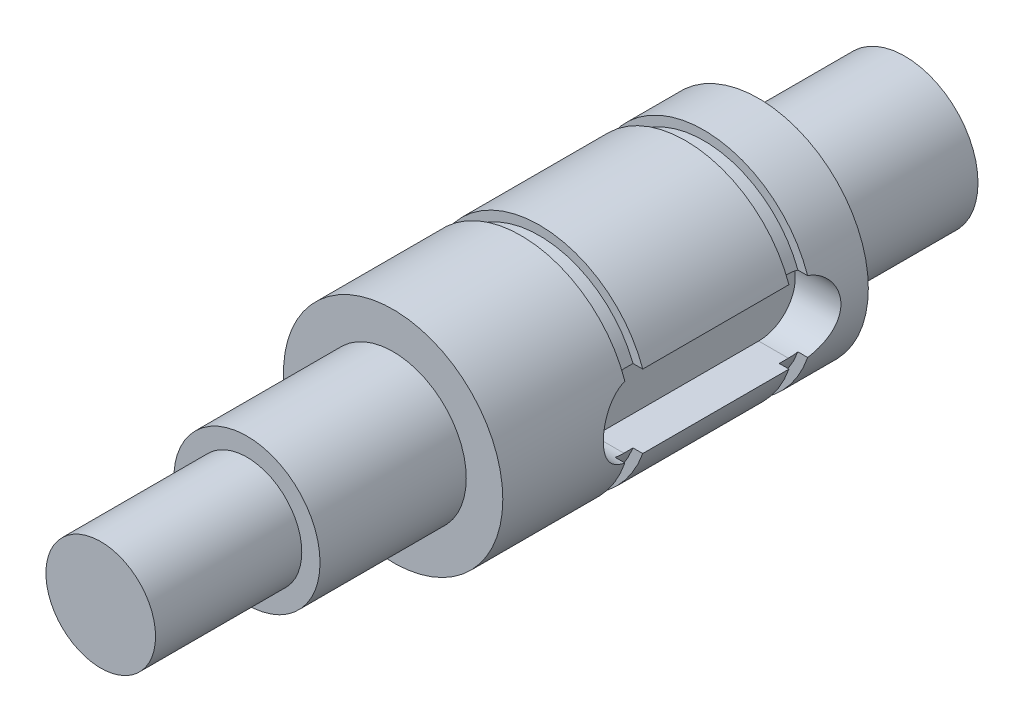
from build123d import *

# Parameters (mm, degrees)
ESQUISSE1_R             = 6
BASE_EXTRUSION_DEPTH    = 20
BOSS_EXTRU_1_DEPTH      = 28
BOSS_EXTRU_1_DEPTH_BACK = 8
ESQUISSE2_R             = 4
ESQUISSE3_R             = 3
BOSS_EXTRU_2_DEPTH      = 8
ESQUISSE4_W             = 1
ESQUISSE4_H             = 0.5
ENL_V_MAT_EXTRU_1_DEPTH = 38.712729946


with BuildPart() as part:
    # Esquisse1 → Base-Extrusion (new body)
    with BuildSketch(Plane.XY):
        with Locations(Location((0, 0, 0), (0, 0, 341.170768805))):
            Circle(ESQUISSE1_R)
    extrude(amount=BASE_EXTRUSION_DEPTH)

    # Esquisse2 → Boss.-Extru.1 (add, two sides: drawn at the far end of the back side and taken through both)
    with BuildSketch(Plane.XY.offset(-BOSS_EXTRU_1_DEPTH_BACK)):
        Circle(ESQUISSE2_R)
    extrude(amount=BOSS_EXTRU_1_DEPTH + BOSS_EXTRU_1_DEPTH_BACK)

    # Esquisse3 → Boss.-Extru.2 (add)
    with BuildSketch(Plane.XY.offset(28)):
        Circle(ESQUISSE3_R)
    extrude(amount=BOSS_EXTRU_2_DEPTH)

    # Esquisse4 → Enl_vement de mati_re-R_volution1 (revolve, cut)
    with BuildSketch(Plane(origin=(0, 0, 0), x_dir=(0, 0, -1), z_dir=(1, 0, 0)), mode=Mode.PRIVATE) as enl_vement_de_mati_re_r_volution1_sk:
        with Locations((-3.5, 5.75)):
            Rectangle(ESQUISSE4_W, ESQUISSE4_H)
        with Locations((-12.5, 5.75)):
            Rectangle(ESQUISSE4_W, ESQUISSE4_H)
    revolve(enl_vement_de_mati_re_r_volution1_sk.sketch.rotate(Axis((0, 0, 2.003766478), (0, 0, -1)), 108.829231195), axis=Axis((0, 0, 2.003766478), (0, 0, -1)), mode=Mode.SUBTRACT)

    # Esquisse5 → Enl_v. mat.-Extru.1 (cut, through all)
    with BuildSketch(Plane(origin=(3.5, 0, 0), x_dir=(0, 0, -1), z_dir=(1, 0, 0))):
        with BuildLine():
            Line((-12.5, 2), (-3.5, 2))
            ThreePointArc((-3.5, 2), (-1.5, 0), (-3.5, -2))
            Line((-3.5, -2), (-12.5, -2))
            ThreePointArc((-12.5, -2), (-14.5, 0), (-12.5, 2))
        make_face()
    extrude(amount=ENL_V_MAT_EXTRU_1_DEPTH, mode=Mode.SUBTRACT)


solid = part.part
